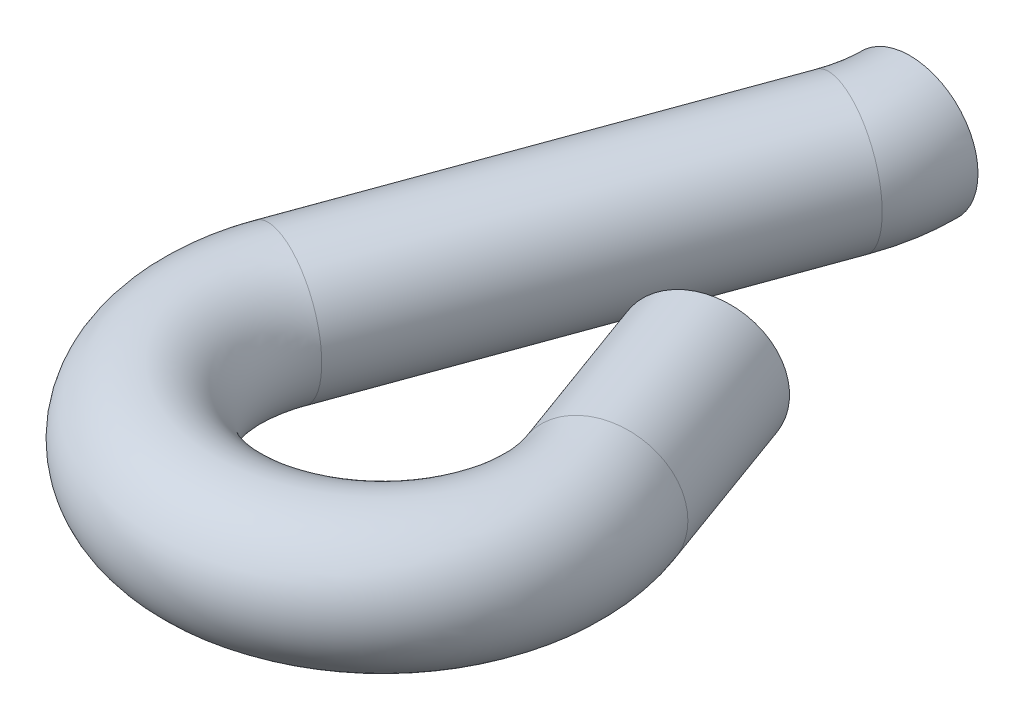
ISO-10303-21;
HEADER;
FILE_DESCRIPTION(('STEP AP214'),'2;1');
FILE_NAME('part.step','',(''),(''),'','','');
FILE_SCHEMA(('AUTOMOTIVE_DESIGN { 1 0 10303 214 1 1 1 1 }'));
ENDSEC;
DATA;
#1=APPLICATION_CONTEXT('core data for automotive mechanical design processes');
#2=APPLICATION_PROTOCOL_DEFINITION('international standard','automotive_design',2000,#1);
#3=PRODUCT_CONTEXT('',#1,'mechanical');
#4=PRODUCT('Part','Part','',(#3));
#5=PRODUCT_RELATED_PRODUCT_CATEGORY('part','',(#4));
#6=PRODUCT_DEFINITION_FORMATION('','',#4);
#7=PRODUCT_DEFINITION_CONTEXT('part definition',#1,'design');
#8=PRODUCT_DEFINITION('design','',#6,#7);
#9=PRODUCT_DEFINITION_SHAPE('','',#8);
#10=(LENGTH_UNIT() NAMED_UNIT(*) SI_UNIT(.MILLI.,.METRE.));
#11=(NAMED_UNIT(*) PLANE_ANGLE_UNIT() SI_UNIT($,.RADIAN.));
#12=(NAMED_UNIT(*) SI_UNIT($,.STERADIAN.) SOLID_ANGLE_UNIT());
#13=UNCERTAINTY_MEASURE_WITH_UNIT(LENGTH_MEASURE(1.E-05),#10,'distance_accuracy_value','');
#14=(GEOMETRIC_REPRESENTATION_CONTEXT(3) GLOBAL_UNCERTAINTY_ASSIGNED_CONTEXT((#13)) GLOBAL_UNIT_ASSIGNED_CONTEXT((#10,
#11,#12)) REPRESENTATION_CONTEXT('',''));
#15=CARTESIAN_POINT('',(0.,0.,0.));
#16=DIRECTION('',(0.,0.,1.));
#17=DIRECTION('',(1.,0.,0.));
#18=AXIS2_PLACEMENT_3D('',#15,#16,#17);
#19=CARTESIAN_POINT('',(0.,0.,-15.5));
#20=DIRECTION('',(0.,0.,1.));
#21=DIRECTION('',(1.,0.,0.));
#22=AXIS2_PLACEMENT_3D('',#19,#20,#21);
#23=PLANE('',#22);
#24=CARTESIAN_POINT('',(-2.,0.,-15.5));
#25=CARTESIAN_POINT('',(-1.99999501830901,-0.112340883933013,-15.5));
#26=CARTESIAN_POINT('',(-1.99050288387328,-0.22476322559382,-15.5));
#27=CARTESIAN_POINT('',(-1.95276859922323,-0.446511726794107,-15.5));
#28=CARTESIAN_POINT('',(-1.92450388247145,-0.55583399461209,-15.5));
#29=CARTESIAN_POINT('',(-1.85002906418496,-0.768137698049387,-15.5));
#30=CARTESIAN_POINT('',(-1.80382753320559,-0.871122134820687,-15.5));
#31=CARTESIAN_POINT('',(-1.69480235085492,-1.06784380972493,-15.5));
#32=CARTESIAN_POINT('',(-1.6319828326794,-1.16158333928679,-15.5));
#33=CARTESIAN_POINT('',(-1.49149220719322,-1.33719709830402,-15.5));
#34=CARTESIAN_POINT('',(-1.41381954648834,-1.41907008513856,-15.5));
#35=CARTESIAN_POINT('',(-1.24582829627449,-1.56861687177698,-15.5));
#36=CARTESIAN_POINT('',(-1.15550921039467,-1.63629011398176,-15.5));
#37=CARTESIAN_POINT('',(-0.964793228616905,-1.75551140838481,-15.5));
#38=CARTESIAN_POINT('',(-0.864396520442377,-1.80705976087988,-15.5));
#39=CARTESIAN_POINT('',(-0.656374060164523,-1.89256952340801,-15.5));
#40=CARTESIAN_POINT('',(-0.548748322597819,-1.92653096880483,-15.5));
#41=CARTESIAN_POINT('',(-0.329322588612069,-1.97590307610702,-15.5));
#42=CARTESIAN_POINT('',(-0.217522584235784,-1.99131370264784,-15.5));
#43=CARTESIAN_POINT('',(0.00707760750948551,-2.00314657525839,-15.5));
#44=CARTESIAN_POINT('',(0.119877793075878,-1.99956885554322,-15.5));
#45=CARTESIAN_POINT('',(0.343276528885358,-1.97352667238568,-15.5));
#46=CARTESIAN_POINT('',(0.453875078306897,-1.95106220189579,-15.5));
#47=CARTESIAN_POINT('',(0.669731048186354,-1.88788417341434,-15.5));
#48=CARTESIAN_POINT('',(0.774988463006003,-1.8471705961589,-15.5));
#49=CARTESIAN_POINT('',(0.977174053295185,-1.74865010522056,-15.5));
#50=CARTESIAN_POINT('',(1.07410223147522,-1.69084319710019,-15.5));
#51=CARTESIAN_POINT('',(1.25687784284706,-1.55977703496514,-15.5));
#52=CARTESIAN_POINT('',(1.34272528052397,-1.48651778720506,-15.5));
#53=CARTESIAN_POINT('',(1.50090251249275,-1.32662653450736,-15.5));
#54=CARTESIAN_POINT('',(1.57323230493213,-1.23999452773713,-15.5));
#55=CARTESIAN_POINT('',(1.70232101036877,-1.05581697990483,-15.5));
#56=CARTESIAN_POINT('',(1.75907992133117,-0.958271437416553,-15.5));
#57=CARTESIAN_POINT('',(1.85541563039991,-0.755035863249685,-15.5));
#58=CARTESIAN_POINT('',(1.89499242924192,-0.649345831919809,-15.5));
#59=CARTESIAN_POINT('',(1.95584044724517,-0.432821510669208,-15.5));
#60=CARTESIAN_POINT('',(1.9771116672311,-0.321987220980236,-15.5));
#61=CARTESIAN_POINT('',(2.00074470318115,-0.0983206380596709,-15.5));
#62=CARTESIAN_POINT('',(2.00310651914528,0.0145116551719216,-15.5));
#63=CARTESIAN_POINT('',(1.98885370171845,0.238971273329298,-15.5));
#64=CARTESIAN_POINT('',(1.97223906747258,0.350598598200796,-15.5));
#65=CARTESIAN_POINT('',(1.92050498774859,0.569479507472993,-15.5));
#66=CARTESIAN_POINT('',(1.88538554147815,0.676733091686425,-15.5));
#67=CARTESIAN_POINT('',(1.7976387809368,0.88382188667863,-15.5));
#68=CARTESIAN_POINT('',(1.74501146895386,0.983657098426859,-15.5));
#69=CARTESIAN_POINT('',(1.62374291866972,1.17307512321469,-15.5));
#70=CARTESIAN_POINT('',(1.55510168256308,1.2626579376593,-15.5));
#71=CARTESIAN_POINT('',(1.40375377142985,1.4290282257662,-15.5));
#72=CARTESIAN_POINT('',(1.32104709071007,1.50581569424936,-15.5));
#73=CARTESIAN_POINT('',(1.14391608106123,1.64441549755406,-15.5));
#74=CARTESIAN_POINT('',(1.04949174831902,1.70622782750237,-15.5));
#75=CARTESIAN_POINT('',(0.851605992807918,1.81312259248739,-15.5));
#76=CARTESIAN_POINT('',(0.748144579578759,1.85820504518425,-15.5));
#77=CARTESIAN_POINT('',(0.535121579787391,1.93036037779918,-15.5));
#78=CARTESIAN_POINT('',(0.425559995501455,1.95743326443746,-15.5));
#79=CARTESIAN_POINT('',(0.203446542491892,1.99280100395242,-15.5));
#80=CARTESIAN_POINT('',(0.0908946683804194,2.00109582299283,-15.5));
#81=CARTESIAN_POINT('',(-0.134003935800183,1.99867186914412,-15.5));
#82=CARTESIAN_POINT('',(-0.24635066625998,1.98795313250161,-15.5));
#83=CARTESIAN_POINT('',(-0.467650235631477,1.94780635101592,-15.5));
#84=CARTESIAN_POINT('',(-0.576603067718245,1.9183782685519,-15.5));
#85=CARTESIAN_POINT('',(-0.788023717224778,1.84164749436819,-15.5));
#86=CARTESIAN_POINT('',(-0.890491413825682,1.79434446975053,-15.5));
#87=CARTESIAN_POINT('',(-1.08602688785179,1.6832086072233,-15.5));
#88=CARTESIAN_POINT('',(-1.17909503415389,1.61937641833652,-15.5));
#89=CARTESIAN_POINT('',(-1.35318491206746,1.47700183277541,-15.5));
#90=CARTESIAN_POINT('',(-1.43420790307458,1.39846097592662,-15.5));
#91=CARTESIAN_POINT('',(-1.5819385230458,1.22886860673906,-15.5));
#92=CARTESIAN_POINT('',(-1.64864258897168,1.13781398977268,-15.5));
#93=CARTESIAN_POINT('',(-1.76584229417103,0.945762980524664,-15.5));
#94=CARTESIAN_POINT('',(-1.81633017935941,0.844761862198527,-15.5));
#95=CARTESIAN_POINT('',(-1.89957454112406,0.635796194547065,-15.5));
#96=CARTESIAN_POINT('',(-1.93235227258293,0.527840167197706,-15.5));
#97=CARTESIAN_POINT('',(-1.97050988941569,0.349330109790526,-15.5));
#98=CARTESIAN_POINT('',(-1.98155487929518,0.279935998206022,-15.5));
#99=CARTESIAN_POINT('',(-1.99630149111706,0.140371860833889,-15.5));
#100=CARTESIAN_POINT('',(-2.00000311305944,0.0702018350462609,-15.5));
#101=CARTESIAN_POINT('',(-2.,0.,-15.5));
#102=B_SPLINE_CURVE_WITH_KNOTS('',3,(#24,#25,#26,#27,#28,#29,#30,#31,#32,#33,#34,#35,#36,#37,
#38,#39,#40,#41,#42,#43,#44,#45,#46,#47,#48,#49,#50,#51,#52,#53,#54,#55,#56,#57,#58,#59,#60,#61,
#62,#63,#64,#65,#66,#67,#68,#69,#70,#71,#72,#73,#74,#75,#76,#77,#78,#79,#80,#81,#82,#83,#84,#85,
#86,#87,#88,#89,#90,#91,#92,#93,#94,#95,#96,#97,#98,#99,#100,#101),.UNSPECIFIED.,.T.,.F.,(4,2,2,
2,2,2,2,2,2,2,2,2,2,2,2,2,2,2,2,2,2,2,2,2,2,2,2,2,2,2,2,2,2,2,2,2,2,2,4),(0.,0.336766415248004,
0.67393839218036,1.01094945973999,1.34787678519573,1.68483936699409,2.02181517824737,
2.3587847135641,2.69575357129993,3.03272307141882,3.36969196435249,3.70666098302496,
4.04363035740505,4.38059962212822,4.71756875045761,5.05453792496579,5.39150714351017,
5.72847634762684,6.06544553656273,6.40241472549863,6.7393839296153,7.07635314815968,
7.41332232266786,7.75029145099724,8.08726071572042,8.42423009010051,8.76119910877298,
9.09816800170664,9.43513750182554,9.77210635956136,10.1090758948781,10.4460517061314,
10.7830142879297,11.1199416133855,11.4569526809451,11.7941246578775,12.1308910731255,
12.3413364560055,12.5517818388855),.UNSPECIFIED.);
#103=CARTESIAN_POINT('',(-2.,0.,-15.5));
#104=VERTEX_POINT('',#103);
#105=EDGE_CURVE('E20',#104,#104,#102,.T.);
#106=ORIENTED_EDGE('',*,*,#105,.F.);
#107=EDGE_LOOP('',(#106));
#108=FACE_BOUND('',#107,.T.);
#109=ADVANCED_FACE('F16',(#108),#23,.F.);
#110=CARTESIAN_POINT('',(-5.,0.,-15.5));
#111=DIRECTION('',(0.,1.,0.));
#112=DIRECTION('',(0.,0.,1.));
#113=AXIS2_PLACEMENT_3D('',#110,#111,#112);
#114=TOROIDAL_SURFACE('',#113,5.,2.);
#115=CARTESIAN_POINT('',(-0.301431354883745,-1.99999999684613,-13.7905177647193));
#116=CARTESIAN_POINT('',(-0.332183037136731,-1.99999885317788,-13.8017061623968));
#117=CARTESIAN_POINT('',(-0.362934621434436,-1.99919321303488,-13.8128945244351));
#118=CARTESIAN_POINT('',(-0.424363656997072,-1.9959779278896,-13.8352442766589));
#119=CARTESIAN_POINT('',(-0.455041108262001,-1.99356828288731,-13.8464056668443));
#120=CARTESIAN_POINT('',(-0.516247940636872,-1.98714997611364,-13.8686745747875));
#121=CARTESIAN_POINT('',(-0.546777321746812,-1.98314131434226,-13.8797820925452));
#122=CARTESIAN_POINT('',(-0.607614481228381,-1.97353484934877,-13.9019165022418));
#123=CARTESIAN_POINT('',(-0.637922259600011,-1.96793704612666,-13.9129433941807));
#124=CARTESIAN_POINT('',(-0.698243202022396,-1.95516572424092,-13.9348899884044));
#125=CARTESIAN_POINT('',(-0.728256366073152,-1.9479922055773,-13.9458096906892));
#126=CARTESIAN_POINT('',(-0.787915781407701,-1.9320867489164,-13.9675156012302));
#127=CARTESIAN_POINT('',(-0.817562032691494,-1.92335481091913,-13.9783018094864));
#128=CARTESIAN_POINT('',(-0.876416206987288,-1.90435354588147,-13.9997147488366));
#129=CARTESIAN_POINT('',(-0.905624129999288,-1.89408421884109,-14.0103414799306));
#130=CARTESIAN_POINT('',(-0.963531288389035,-1.87203291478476,-14.0314098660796));
#131=CARTESIAN_POINT('',(-0.992230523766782,-1.8602509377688,-14.0418515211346));
#132=CARTESIAN_POINT('',(-1.04905117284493,-1.83520271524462,-14.0625246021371));
#133=CARTESIAN_POINT('',(-1.07717258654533,-1.82193646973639,-14.0727560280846));
#134=CARTESIAN_POINT('',(-1.13276985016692,-1.7939516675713,-14.0929840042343));
#135=CARTESIAN_POINT('',(-1.1602457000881,-1.77923311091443,-14.1029805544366));
#136=CARTESIAN_POINT('',(-1.21448564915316,-1.74837914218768,-14.122714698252));
#137=CARTESIAN_POINT('',(-1.24124974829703,-1.73224373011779,-14.1324522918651));
#138=CARTESIAN_POINT('',(-1.29400172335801,-1.69859491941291,-14.1516450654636));
#139=CARTESIAN_POINT('',(-1.31998959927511,-1.6810815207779,-14.161100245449));
#140=CARTESIAN_POINT('',(-1.37112652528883,-1.64471892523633,-14.1797054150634));
#141=CARTESIAN_POINT('',(-1.39627557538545,-1.62586972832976,-14.1888554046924));
#142=CARTESIAN_POINT('',(-1.44567426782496,-1.58688094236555,-14.2068281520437));
#143=CARTESIAN_POINT('',(-1.46992391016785,-1.56674135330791,-14.215650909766));
#144=CARTESIAN_POINT('',(-1.51746537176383,-1.52522029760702,-14.2329479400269));
#145=CARTESIAN_POINT('',(-1.54075719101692,-1.50383883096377,-14.2414222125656));
#146=CARTESIAN_POINT('',(-1.58632689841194,-1.45988552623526,-14.2580018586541));
#147=CARTESIAN_POINT('',(-1.60860478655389,-1.43731368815,-14.266107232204));
#148=CARTESIAN_POINT('',(-1.65209296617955,-1.3910340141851,-14.2819295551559));
#149=CARTESIAN_POINT('',(-1.67330325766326,-1.36732617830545,-14.289646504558));
#150=CARTESIAN_POINT('',(-1.71460515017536,-1.31883161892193,-14.3046733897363));
#151=CARTESIAN_POINT('',(-1.73469675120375,-1.29404489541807,-14.3119833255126));
#152=CARTESIAN_POINT('',(-1.77371286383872,-1.24345226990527,-14.3261785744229));
#153=CARTESIAN_POINT('',(-1.79263737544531,-1.21764636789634,-14.3330638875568));
#154=CARTESIAN_POINT('',(-1.82927372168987,-1.16507754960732,-14.3463933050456));
#155=CARTESIAN_POINT('',(-1.84698555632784,-1.13831463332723,-14.3528374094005));
#156=CARTESIAN_POINT('',(-1.88115388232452,-1.0838962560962,-14.3652688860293));
#157=CARTESIAN_POINT('',(-1.89761037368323,-1.05624079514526,-14.3712562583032));
#158=CARTESIAN_POINT('',(-1.92922837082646,-1.00010394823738,-14.3827598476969));
#159=CARTESIAN_POINT('',(-1.94438987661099,-0.971622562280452,-14.3882760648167));
#160=CARTESIAN_POINT('',(-1.97338137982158,-0.913902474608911,-14.398824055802));
#161=CARTESIAN_POINT('',(-1.98721137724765,-0.884663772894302,-14.4038558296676));
#162=CARTESIAN_POINT('',(-2.013506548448,-0.825499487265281,-14.4134228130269));
#163=CARTESIAN_POINT('',(-2.02597172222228,-0.79557390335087,-14.4179580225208));
#164=CARTESIAN_POINT('',(-2.04950721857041,-0.735107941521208,-14.426520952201));
#165=CARTESIAN_POINT('',(-2.06057754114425,-0.704567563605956,-14.4305486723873));
#166=CARTESIAN_POINT('',(-2.08129666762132,-0.642945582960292,-14.4380869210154));
#167=CARTESIAN_POINT('',(-2.09094547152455,-0.611863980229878,-14.4415974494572));
#168=CARTESIAN_POINT('',(-2.1087983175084,-0.549234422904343,-14.4480928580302));
#169=CARTESIAN_POINT('',(-2.11700235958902,-0.517686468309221,-14.4510777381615));
#170=CARTESIAN_POINT('',(-2.13194591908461,-0.454200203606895,-14.45651465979));
#171=CARTESIAN_POINT('',(-2.13868543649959,-0.422261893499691,-14.4589667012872));
#172=CARTESIAN_POINT('',(-2.15068371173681,-0.358071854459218,-14.4633320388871));
#173=CARTESIAN_POINT('',(-2.15594246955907,-0.32582012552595,-14.4652453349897));
#174=CARTESIAN_POINT('',(-2.16496655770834,-0.261080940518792,-14.4685285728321));
#175=CARTESIAN_POINT('',(-2.16873188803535,-0.228593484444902,-14.4698985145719));
#176=CARTESIAN_POINT('',(-2.17476005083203,-0.163461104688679,-14.4720917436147));
#177=CARTESIAN_POINT('',(-2.17702288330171,-0.130816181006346,-14.4729150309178));
#178=CARTESIAN_POINT('',(-2.18004059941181,-0.0654475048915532,-14.474012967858));
#179=CARTESIAN_POINT('',(-2.18079548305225,-0.0327237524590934,-14.474287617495));
#180=CARTESIAN_POINT('',(-2.18079548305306,0.0327237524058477,-14.4742876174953));
#181=CARTESIAN_POINT('',(-2.18004059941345,0.0654475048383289,-14.4740129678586));
#182=CARTESIAN_POINT('',(-2.17702288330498,0.130816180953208,-14.472915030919));
#183=CARTESIAN_POINT('',(-2.17476005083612,0.163461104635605,-14.4720917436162));
#184=CARTESIAN_POINT('',(-2.16873188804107,0.228593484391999,-14.4698985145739));
#185=CARTESIAN_POINT('',(-2.16496655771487,0.261080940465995,-14.4685285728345));
#186=CARTESIAN_POINT('',(-2.15594246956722,0.325820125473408,-14.4652453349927));
#187=CARTESIAN_POINT('',(-2.15068371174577,0.358071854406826,-14.4633320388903));
#188=CARTESIAN_POINT('',(-2.13868543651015,0.422261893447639,-14.458966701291));
#189=CARTESIAN_POINT('',(-2.13194591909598,0.454200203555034,-14.4565146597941));
#190=CARTESIAN_POINT('',(-2.11700235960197,0.517686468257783,-14.4510777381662));
#191=CARTESIAN_POINT('',(-2.10879831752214,0.549234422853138,-14.4480928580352));
#192=CARTESIAN_POINT('',(-2.09094547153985,0.611863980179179,-14.4415974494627));
#193=CARTESIAN_POINT('',(-2.0812966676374,0.642945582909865,-14.4380869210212));
#194=CARTESIAN_POINT('',(-2.06057754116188,0.704567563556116,-14.4305486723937));
#195=CARTESIAN_POINT('',(-2.0495072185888,0.735107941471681,-14.4265209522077));
#196=CARTESIAN_POINT('',(-2.02597172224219,0.795573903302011,-14.417958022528));
#197=CARTESIAN_POINT('',(-2.01350654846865,0.825499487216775,-14.4134228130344));
#198=CARTESIAN_POINT('',(-1.98721137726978,0.884663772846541,-14.4038558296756));
#199=CARTESIAN_POINT('',(-1.97338137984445,0.913902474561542,-14.3988240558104));
#200=CARTESIAN_POINT('',(-1.9443898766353,0.971622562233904,-14.3882760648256));
#201=CARTESIAN_POINT('',(-1.92922837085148,1.00010394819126,-14.382759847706));
#202=CARTESIAN_POINT('',(-1.89761037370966,1.05624079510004,-14.3712562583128));
#203=CARTESIAN_POINT('',(-1.88115388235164,1.08389625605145,-14.3652688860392));
#204=CARTESIAN_POINT('',(-1.84698555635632,1.13831463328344,-14.3528374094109));
#205=CARTESIAN_POINT('',(-1.82927372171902,1.16507754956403,-14.3463933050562));
#206=CARTESIAN_POINT('',(-1.79263737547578,1.21764636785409,-14.3330638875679));
#207=CARTESIAN_POINT('',(-1.77371286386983,1.24345226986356,-14.3261785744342));
#208=CARTESIAN_POINT('',(-1.73469675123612,1.29404489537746,-14.3119833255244));
#209=CARTESIAN_POINT('',(-1.71460515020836,1.31883161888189,-14.3046733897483));
#210=CARTESIAN_POINT('',(-1.67330325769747,1.36732617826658,-14.2896465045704));
#211=CARTESIAN_POINT('',(-1.65209296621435,1.39103401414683,-14.2819295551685));
#212=CARTESIAN_POINT('',(-1.60860478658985,1.43731368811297,-14.2661072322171));
#213=CARTESIAN_POINT('',(-1.58632689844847,1.45988552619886,-14.2580018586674));
#214=CARTESIAN_POINT('',(-1.54075719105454,1.50383883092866,-14.2414222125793));
#215=CARTESIAN_POINT('',(-1.51746537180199,1.52522029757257,-14.2329479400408));
#216=CARTESIAN_POINT('',(-1.46992391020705,1.5667413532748,-14.2156509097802));
#217=CARTESIAN_POINT('',(-1.44567426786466,1.58688094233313,-14.2068281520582));
#218=CARTESIAN_POINT('',(-1.39627557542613,1.62586972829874,-14.1888554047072));
#219=CARTESIAN_POINT('',(-1.37112652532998,1.64471892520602,-14.1797054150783));
#220=CARTESIAN_POINT('',(-1.31998959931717,1.68108152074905,-14.1611002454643));
#221=CARTESIAN_POINT('',(-1.2940017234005,1.69859491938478,-14.1516450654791));
#222=CARTESIAN_POINT('',(-1.24124974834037,1.73224373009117,-14.1324522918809));
#223=CARTESIAN_POINT('',(-1.2144856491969,1.74837914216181,-14.1227146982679));
#224=CARTESIAN_POINT('',(-1.16024570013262,1.7792331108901,-14.1029805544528));
#225=CARTESIAN_POINT('',(-1.1327698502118,1.79395166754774,-14.0929840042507));
#226=CARTESIAN_POINT('',(-1.07717258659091,1.82193646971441,-14.0727560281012));
#227=CARTESIAN_POINT('',(-1.04905117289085,1.83520271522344,-14.0625246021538));
#228=CARTESIAN_POINT('',(-0.992230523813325,1.86025093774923,-14.0418515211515));
#229=CARTESIAN_POINT('',(-0.963531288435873,1.872032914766,-14.0314098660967));
#230=CARTESIAN_POINT('',(-0.905624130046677,1.89408421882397,-14.0103414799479));
#231=CARTESIAN_POINT('',(-0.876416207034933,1.90435354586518,-13.999714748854));
#232=CARTESIAN_POINT('',(-0.817562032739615,1.9233548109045,-13.9783018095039));
#233=CARTESIAN_POINT('',(-0.787915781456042,1.93208674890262,-13.9675156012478));
#234=CARTESIAN_POINT('',(-0.728256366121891,1.94799220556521,-13.9458096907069));
#235=CARTESIAN_POINT('',(-0.698243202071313,1.95516572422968,-13.9348899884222));
#236=CARTESIAN_POINT('',(-0.637922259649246,1.96793704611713,-13.9129433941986));
#237=CARTESIAN_POINT('',(-0.607614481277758,1.9735348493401,-13.9019165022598));
#238=CARTESIAN_POINT('',(-0.546777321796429,1.98314131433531,-13.8797820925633));
#239=CARTESIAN_POINT('',(-0.516247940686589,1.98714997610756,-13.8686745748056));
#240=CARTESIAN_POINT('',(-0.455041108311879,1.99356828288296,-13.8464056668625));
#241=CARTESIAN_POINT('',(-0.424363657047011,1.99597792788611,-13.8352442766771));
#242=CARTESIAN_POINT('',(-0.362934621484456,1.99919321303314,-13.8128945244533));
#243=CARTESIAN_POINT('',(-0.33218303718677,1.99999885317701,-13.801706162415));
#244=CARTESIAN_POINT('',(-0.301431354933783,1.99999999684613,-13.7905177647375));
#245=B_SPLINE_CURVE_WITH_KNOTS('',3,(#115,#116,#117,#118,#119,#120,#121,#122,#123,#124,#125,
#126,#127,#128,#129,#130,#131,#132,#133,#134,#135,#136,#137,#138,#139,#140,#141,#142,#143,#144,
#145,#146,#147,#148,#149,#150,#151,#152,#153,#154,#155,#156,#157,#158,#159,#160,#161,#162,#163,
#164,#165,#166,#167,#168,#169,#170,#171,#172,#173,#174,#175,#176,#177,#178,#179,#180,#181,#182,
#183,#184,#185,#186,#187,#188,#189,#190,#191,#192,#193,#194,#195,#196,#197,#198,#199,#200,#201,
#202,#203,#204,#205,#206,#207,#208,#209,#210,#211,#212,#213,#214,#215,#216,#217,#218,#219,#220,
#221,#222,#223,#224,#225,#226,#227,#228,#229,#230,#231,#232,#233,#234,#235,#236,#237,#238,#239,
#240,#241,#242,#243,#244),.UNSPECIFIED.,.F.,.F.,(4,2,2,2,2,2,2,2,2,2,2,2,2,2,2,2,2,2,2,2,2,2,2,
2,2,2,2,2,2,2,2,2,2,2,2,2,2,2,2,2,2,2,2,2,2,2,2,2,2,2,2,2,2,2,2,2,2,2,2,2,2,2,2,2,4),(0.,
0.0981614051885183,0.196322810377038,0.294484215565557,0.392645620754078,0.490807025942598,
0.588968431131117,0.687129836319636,0.785291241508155,0.883452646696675,0.981614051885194,
1.07977545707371,1.17793686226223,1.27609826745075,1.37425967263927,1.47242107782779,
1.57058248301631,1.66874388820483,1.76690529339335,1.86506669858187,1.96322810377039,
2.06138950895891,2.15955091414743,2.25771231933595,2.35587372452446,2.45403512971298,
2.5521965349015,2.65035794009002,2.74851934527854,2.84668075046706,2.94484215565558,
3.0430035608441,3.14116496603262,3.23932637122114,3.33748777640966,3.43564918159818,
3.5338105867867,3.63197199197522,3.73013339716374,3.82829480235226,3.92645620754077,
4.02461761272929,4.12277901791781,4.22094042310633,4.31910182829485,4.41726323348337,
4.51542463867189,4.61358604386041,4.71174744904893,4.80990885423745,4.90807025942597,
5.00623166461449,5.10439306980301,5.20255447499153,5.30071588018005,5.39887728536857,
5.49703869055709,5.5952000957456,5.69336150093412,5.79152290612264,5.88968431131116,
5.98784571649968,6.0860071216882,6.18416852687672,6.28232993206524),.UNSPECIFIED.);
#246=CARTESIAN_POINT('',(-0.301536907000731,1.99999999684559,-13.790227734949));
#247=VERTEX_POINT('',#246);
#248=CARTESIAN_POINT('',(-0.30153690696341,-1.99999999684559,-13.7902277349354));
#249=VERTEX_POINT('',#248);
#250=EDGE_CURVE('E37',#247,#249,#245,.F.);
#251=ORIENTED_EDGE('',*,*,#250,.F.);
#252=CARTESIAN_POINT('',(-0.301642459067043,1.99999999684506,-13.7899377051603));
#253=CARTESIAN_POINT('',(-0.270889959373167,2.00000252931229,-13.7787447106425));
#254=CARTESIAN_POINT('',(-0.240137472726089,1.99920045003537,-13.7675517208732));
#255=CARTESIAN_POINT('',(-0.178706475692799,1.99599204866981,-13.7451926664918));
#256=CARTESIAN_POINT('',(-0.148027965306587,1.99358572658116,-13.7340266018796));
#257=CARTESIAN_POINT('',(-0.0868188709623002,1.98717382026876,-13.7117483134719));
#258=CARTESIAN_POINT('',(-0.0562882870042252,1.983168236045,-13.7006360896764));
#259=CARTESIAN_POINT('',(0.00455140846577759,1.97356767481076,-13.6784922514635));
#260=CARTESIAN_POINT('',(0.0348605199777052,1.96797269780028,-13.6674606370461));
#261=CARTESIAN_POINT('',(0.0951842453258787,1.95520677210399,-13.6455045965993));
#262=CARTESIAN_POINT('',(0.125198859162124,1.94803582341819,-13.6345801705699));
#263=CARTESIAN_POINT('',(0.184861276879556,1.93213524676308,-13.6128648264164));
#264=CARTESIAN_POINT('',(0.214509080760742,1.92340561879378,-13.6020739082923));
#265=CARTESIAN_POINT('',(0.273366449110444,1.90440871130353,-13.5806515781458));
#266=CARTESIAN_POINT('',(0.302576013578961,1.89414143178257,-13.5700201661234));
#267=CARTESIAN_POINT('',(0.36048652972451,1.87209395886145,-13.5489424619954));
#268=CARTESIAN_POINT('',(0.389187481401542,1.86031376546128,-13.5384961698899));
#269=CARTESIAN_POINT('',(0.446011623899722,1.83526884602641,-13.5178138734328));
#270=CARTESIAN_POINT('',(0.474134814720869,1.8220041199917,-13.5075778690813));
#271=CARTESIAN_POINT('',(0.529735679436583,1.79402209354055,-13.4873408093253));
#272=CARTESIAN_POINT('',(0.55721335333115,1.77930479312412,-13.4773397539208));
#273=CARTESIAN_POINT('',(0.611456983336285,1.74845307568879,-13.4575966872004));
#274=CARTESIAN_POINT('',(0.638222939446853,1.73231865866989,-13.4478546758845));
#275=CARTESIAN_POINT('',(0.690978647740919,1.69867158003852,-13.4286531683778));
#276=CARTESIAN_POINT('',(0.716968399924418,1.68115891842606,-13.4191936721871));
#277=CARTESIAN_POINT('',(0.768109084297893,1.64479754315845,-13.4005799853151));
#278=CARTESIAN_POINT('',(0.793260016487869,1.62594882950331,-13.3914257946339));
#279=CARTESIAN_POINT('',(0.842662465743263,1.58696076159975,-13.3734447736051));
#280=CARTESIAN_POINT('',(0.86691398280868,1.56682140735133,-13.3646179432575));
#281=CARTESIAN_POINT('',(0.914459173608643,1.52530057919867,-13.3473129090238));
#282=CARTESIAN_POINT('',(0.93775284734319,1.50391910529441,-13.3388347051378));
#283=CARTESIAN_POINT('',(0.983326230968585,1.45996555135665,-13.3222473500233));
#284=CARTESIAN_POINT('',(1.00560594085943,1.43739347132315,-13.314138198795));
#285=CARTESIAN_POINT('',(1.04909771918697,1.39111308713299,-13.2983084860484));
#286=CARTESIAN_POINT('',(1.07030978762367,1.36740478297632,-13.2905879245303));
#287=CARTESIAN_POINT('',(1.11161517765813,1.3189090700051,-13.275553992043));
#288=CARTESIAN_POINT('',(1.1317084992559,1.29412166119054,-13.2682406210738));
#289=CARTESIAN_POINT('',(1.17072798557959,1.24352745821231,-13.2540386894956));
#290=CARTESIAN_POINT('',(1.18965415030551,1.21772066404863,-13.2471501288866));
#291=CARTESIAN_POINT('',(1.22629372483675,1.16514986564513,-13.233814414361));
#292=CARTESIAN_POINT('',(1.24400713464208,1.13838586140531,-13.2273672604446));
#293=CARTESIAN_POINT('',(1.27817852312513,1.0839651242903,-13.2149298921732));
#294=CARTESIAN_POINT('',(1.29463650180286,1.05630839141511,-13.2089396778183));
#295=CARTESIAN_POINT('',(1.32625737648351,1.00016882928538,-13.1974306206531));
#296=CARTESIAN_POINT('',(1.34142027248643,0.971686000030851,-13.1919117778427));
#297=CARTESIAN_POINT('',(1.37041445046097,0.913962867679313,-13.181358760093));
#298=CARTESIAN_POINT('',(1.38424573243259,0.884722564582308,-13.1763245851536));
#299=CARTESIAN_POINT('',(1.41054335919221,0.825554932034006,-13.1667530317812));
#300=CARTESIAN_POINT('',(1.42300970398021,0.795627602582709,-13.1622156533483));
#301=CARTESIAN_POINT('',(1.44654742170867,0.735158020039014,-13.1536486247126));
#302=CARTESIAN_POINT('',(1.45761879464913,0.704615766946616,-13.1496189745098));
#303=CARTESIAN_POINT('',(1.47833989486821,0.642989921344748,-13.1420771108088));
#304=CARTESIAN_POINT('',(1.48798962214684,0.611906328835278,-13.1385648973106));
#305=CARTESIAN_POINT('',(1.50584418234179,0.549272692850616,-13.1320663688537));
#306=CARTESIAN_POINT('',(1.51404901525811,0.517722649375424,-13.1290800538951));
#307=CARTESIAN_POINT('',(1.52899401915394,0.454232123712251,-13.123640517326));
#308=CARTESIAN_POINT('',(1.53573419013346,0.42229164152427,-13.1211872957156));
#309=CARTESIAN_POINT('',(1.54773363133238,0.358097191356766,-13.1168198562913));
#310=CARTESIAN_POINT('',(1.55299290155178,0.325843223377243,-13.1149056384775));
#311=CARTESIAN_POINT('',(1.56201787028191,0.26109950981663,-13.1116208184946));
#312=CARTESIAN_POINT('',(1.56578356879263,0.22860976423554,-13.1102502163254));
#313=CARTESIAN_POINT('',(1.57181232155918,0.16347277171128,-13.1080559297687));
#314=CARTESIAN_POINT('',(1.57407537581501,0.13082552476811,-13.107232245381));
#315=CARTESIAN_POINT('',(1.57709338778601,0.0654521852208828,-13.1061337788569));
#316=CARTESIAN_POINT('',(1.57784834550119,0.0327260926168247,-13.1058589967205));
#317=CARTESIAN_POINT('',(1.57784834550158,-0.0327260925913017,-13.1058589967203));
#318=CARTESIAN_POINT('',(1.57709338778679,-0.0654521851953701,-13.1061337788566));
#319=CARTESIAN_POINT('',(1.57407537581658,-0.130825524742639,-13.1072322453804));
#320=CARTESIAN_POINT('',(1.57181232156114,-0.16347277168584,-13.1080559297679));
#321=CARTESIAN_POINT('',(1.56578356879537,-0.228609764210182,-13.1102502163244));
#322=CARTESIAN_POINT('',(1.56201787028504,-0.261099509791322,-13.1116208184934));
#323=CARTESIAN_POINT('',(1.55299290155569,-0.325843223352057,-13.1149056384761));
#324=CARTESIAN_POINT('',(1.54773363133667,-0.358097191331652,-13.1168198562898));
#325=CARTESIAN_POINT('',(1.53573419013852,-0.422291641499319,-13.1211872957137));
#326=CARTESIAN_POINT('',(1.52899401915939,-0.454232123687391,-13.123640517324));
#327=CARTESIAN_POINT('',(1.51404901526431,-0.517722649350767,-13.1290800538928));
#328=CARTESIAN_POINT('',(1.50584418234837,-0.549272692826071,-13.1320663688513));
#329=CARTESIAN_POINT('',(1.48798962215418,-0.611906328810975,-13.1385648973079));
#330=CARTESIAN_POINT('',(1.47833989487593,-0.642989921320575,-13.142077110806));
#331=CARTESIAN_POINT('',(1.45761879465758,-0.704615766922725,-13.1496189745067));
#332=CARTESIAN_POINT('',(1.44654742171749,-0.735158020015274,-13.1536486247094));
#333=CARTESIAN_POINT('',(1.42300970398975,-0.795627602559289,-13.1622156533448));
#334=CARTESIAN_POINT('',(1.4105433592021,-0.825554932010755,-13.1667530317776));
#335=CARTESIAN_POINT('',(1.38424573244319,-0.884722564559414,-13.1763245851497));
#336=CARTESIAN_POINT('',(1.37041445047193,-0.913962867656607,-13.181358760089));
#337=CARTESIAN_POINT('',(1.34142027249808,-0.971686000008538,-13.1919117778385));
#338=CARTESIAN_POINT('',(1.3262573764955,-1.00016882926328,-13.1974306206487));
#339=CARTESIAN_POINT('',(1.29463650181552,-1.05630839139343,-13.2089396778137));
#340=CARTESIAN_POINT('',(1.27817852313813,-1.08396512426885,-13.2149298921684));
#341=CARTESIAN_POINT('',(1.24400713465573,-1.13838586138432,-13.2273672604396));
#342=CARTESIAN_POINT('',(1.22629372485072,-1.16514986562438,-13.233814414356));
#343=CARTESIAN_POINT('',(1.18965415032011,-1.21772066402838,-13.2471501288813));
#344=CARTESIAN_POINT('',(1.1707279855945,-1.24352745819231,-13.2540386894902));
#345=CARTESIAN_POINT('',(1.13170849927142,-1.29412166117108,-13.2682406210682));
#346=CARTESIAN_POINT('',(1.11161517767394,-1.31890906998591,-13.2755539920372));
#347=CARTESIAN_POINT('',(1.07030978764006,-1.36740478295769,-13.2905879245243));
#348=CARTESIAN_POINT('',(1.04909771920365,-1.39111308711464,-13.2983084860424));
#349=CARTESIAN_POINT('',(1.00560594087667,-1.4373934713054,-13.3141381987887));
#350=CARTESIAN_POINT('',(0.983326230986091,-1.4599655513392,-13.3222473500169));
#351=CARTESIAN_POINT('',(0.937752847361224,-1.50391910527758,-13.3388347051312));
#352=CARTESIAN_POINT('',(0.914459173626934,-1.52530057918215,-13.3473129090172));
#353=CARTESIAN_POINT('',(0.866913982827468,-1.56682140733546,-13.3646179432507));
#354=CARTESIAN_POINT('',(0.842662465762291,-1.58696076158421,-13.3734447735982));
#355=CARTESIAN_POINT('',(0.793260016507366,-1.62594882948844,-13.3914257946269));
#356=CARTESIAN_POINT('',(0.768109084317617,-1.64479754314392,-13.400579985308));
#357=CARTESIAN_POINT('',(0.716968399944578,-1.68115891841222,-13.4191936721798));
#358=CARTESIAN_POINT('',(0.690978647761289,-1.69867158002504,-13.4286531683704));
#359=CARTESIAN_POINT('',(0.638222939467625,-1.73231865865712,-13.447854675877));
#360=CARTESIAN_POINT('',(0.61145698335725,-1.74845307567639,-13.4575966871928));
#361=CARTESIAN_POINT('',(0.557213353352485,-1.77930479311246,-13.4773397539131));
#362=CARTESIAN_POINT('',(0.529735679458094,-1.79402209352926,-13.4873408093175));
#363=CARTESIAN_POINT('',(0.474134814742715,-1.82200411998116,-13.5075778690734));
#364=CARTESIAN_POINT('',(0.446011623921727,-1.83526884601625,-13.5178138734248));
#365=CARTESIAN_POINT('',(0.389187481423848,-1.8603137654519,-13.5384961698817));
#366=CARTESIAN_POINT('',(0.360486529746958,-1.87209395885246,-13.5489424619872));
#367=CARTESIAN_POINT('',(0.302576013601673,-1.89414143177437,-13.5700201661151));
#368=CARTESIAN_POINT('',(0.273366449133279,-1.90440871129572,-13.5806515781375));
#369=CARTESIAN_POINT('',(0.214509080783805,-1.92340561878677,-13.6020739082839));
#370=CARTESIAN_POINT('',(0.184861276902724,-1.93213524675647,-13.612864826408));
#371=CARTESIAN_POINT('',(0.125198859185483,-1.94803582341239,-13.6345801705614));
#372=CARTESIAN_POINT('',(0.0951842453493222,-1.95520677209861,-13.6455045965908));
#373=CARTESIAN_POINT('',(0.0348605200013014,-1.96797269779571,-13.6674606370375));
#374=CARTESIAN_POINT('',(0.00455140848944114,-1.9735676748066,-13.6784922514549));
#375=CARTESIAN_POINT('',(-0.0562882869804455,-1.98316823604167,-13.7006360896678));
#376=CARTESIAN_POINT('',(-0.086818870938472,-1.98717382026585,-13.7117483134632));
#377=CARTESIAN_POINT('',(-0.148027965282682,-1.99358572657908,-13.7340266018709));
#378=CARTESIAN_POINT('',(-0.178706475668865,-1.99599204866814,-13.7451926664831));
#379=CARTESIAN_POINT('',(-0.240137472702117,-1.99920045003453,-13.7675517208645));
#380=CARTESIAN_POINT('',(-0.270889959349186,-2.00000252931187,-13.7787447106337));
#381=CARTESIAN_POINT('',(-0.301642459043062,-1.99999999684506,-13.7899377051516));
#382=B_SPLINE_CURVE_WITH_KNOTS('',3,(#252,#253,#254,#255,#256,#257,#258,#259,#260,#261,#262,
#263,#264,#265,#266,#267,#268,#269,#270,#271,#272,#273,#274,#275,#276,#277,#278,#279,#280,#281,
#282,#283,#284,#285,#286,#287,#288,#289,#290,#291,#292,#293,#294,#295,#296,#297,#298,#299,#300,
#301,#302,#303,#304,#305,#306,#307,#308,#309,#310,#311,#312,#313,#314,#315,#316,#317,#318,#319,
#320,#321,#322,#323,#324,#325,#326,#327,#328,#329,#330,#331,#332,#333,#334,#335,#336,#337,#338,
#339,#340,#341,#342,#343,#344,#345,#346,#347,#348,#349,#350,#351,#352,#353,#354,#355,#356,#357,
#358,#359,#360,#361,#362,#363,#364,#365,#366,#367,#368,#369,#370,#371,#372,#373,#374,#375,#376,
#377,#378,#379,#380,#381),.UNSPECIFIED.,.F.,.F.,(4,2,2,2,2,2,2,2,2,2,2,2,2,2,2,2,2,2,2,2,2,2,2,
2,2,2,2,2,2,2,2,2,2,2,2,2,2,2,2,2,2,2,2,2,2,2,2,2,2,2,2,2,2,2,2,2,2,2,2,2,2,2,2,2,4),(0.,
0.0981684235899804,0.196336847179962,0.294505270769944,0.392673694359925,0.490842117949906,
0.589010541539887,0.687178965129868,0.785347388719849,0.88351581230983,0.981684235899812,
1.07985265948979,1.17802108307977,1.27618950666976,1.37435793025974,1.47252635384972,
1.5706947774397,1.66886320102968,1.76703162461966,1.86520004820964,1.96336847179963,
2.06153689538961,2.15970531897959,2.25787374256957,2.35604216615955,2.45421058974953,
2.55237901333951,2.6505474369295,2.74871586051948,2.84688428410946,2.94505270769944,
3.04322113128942,3.1413895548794,3.23955797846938,3.33772640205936,3.43589482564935,
3.53406324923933,3.63223167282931,3.73040009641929,3.82856852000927,3.92673694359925,
4.02490536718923,4.12307379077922,4.2212422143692,4.31941063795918,4.41757906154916,
4.51574748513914,4.61391590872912,4.7120843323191,4.81025275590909,4.90842117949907,
5.00658960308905,5.10475802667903,5.20292645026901,5.30109487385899,5.39926329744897,
5.49743172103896,5.59560014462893,5.69376856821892,5.7919369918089,5.89010541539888,
5.98827383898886,6.08644226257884,6.18461068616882,6.28277910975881),.UNSPECIFIED.);
#383=EDGE_CURVE('E34',#249,#247,#382,.F.);
#384=ORIENTED_EDGE('',*,*,#383,.F.);
#385=EDGE_LOOP('',(#251,#384));
#386=FACE_BOUND('',#385,.T.);
#387=ORIENTED_EDGE('',*,*,#105,.T.);
#388=EDGE_LOOP('',(#387));
#389=FACE_BOUND('',#388,.T.);
#390=ADVANCED_FACE('F39',(#386,#389),#114,.T.);
#391=CARTESIAN_POINT('',(2.98836239,0.,-6.40856382));
#392=DIRECTION('',(-0.342020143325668,0.,-0.939692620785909));
#393=DIRECTION('',(-0.939692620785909,0.,0.342020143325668));
#394=AXIS2_PLACEMENT_3D('',#391,#392,#393);
#395=PLANE('',#394);
#396=CARTESIAN_POINT('',(2.98836239,0.,-6.40856382));
#397=DIRECTION('',(-0.342020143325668,0.,-0.939692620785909));
#398=DIRECTION('',(-0.939692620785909,0.,0.342020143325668));
#399=AXIS2_PLACEMENT_3D('',#396,#397,#398);
#400=CIRCLE('',#399,2.);
#401=CARTESIAN_POINT('',(1.10897714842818,0.,-5.72452353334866));
#402=VERTEX_POINT('',#401);
#403=EDGE_CURVE('E48',#402,#402,#400,.F.);
#404=ORIENTED_EDGE('',*,*,#403,.F.);
#405=EDGE_LOOP('',(#404));
#406=FACE_BOUND('',#405,.T.);
#407=ADVANCED_FACE('F67',(#406),#395,.T.);
#408=CARTESIAN_POINT('',(-2.50000000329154,0.,-7.75032844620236));
#409=DIRECTION('',(0.342020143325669,0.,-0.939692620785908));
#410=DIRECTION('',(-0.939692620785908,0.,-0.342020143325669));
#411=AXIS2_PLACEMENT_3D('',#408,#409,#410);
#412=CYLINDRICAL_SURFACE('',#411,2.);
#413=ORIENTED_EDGE('',*,*,#250,.T.);
#414=ORIENTED_EDGE('',*,*,#383,.T.);
#415=EDGE_LOOP('',(#413,#414));
#416=FACE_BOUND('',#415,.T.);
#417=CARTESIAN_POINT('',(-4.69846310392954,0.,-1.71010071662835));
#418=DIRECTION('',(0.34202014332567,0.,-0.939692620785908));
#419=DIRECTION('',(-0.939692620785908,0.,-0.34202014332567));
#420=AXIS2_PLACEMENT_3D('',#417,#418,#419);
#421=CIRCLE('',#420,2.);
#422=CARTESIAN_POINT('',(-6.57784834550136,0.,-2.39414100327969));
#423=VERTEX_POINT('',#422);
#424=EDGE_CURVE('E28',#423,#423,#421,.F.);
#425=ORIENTED_EDGE('',*,*,#424,.F.);
#426=EDGE_LOOP('',(#425));
#427=FACE_BOUND('',#426,.T.);
#428=ADVANCED_FACE('F46',(#416,#427),#412,.T.);
#429=CARTESIAN_POINT('',(3.84341274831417,0.,-4.05933226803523));
#430=DIRECTION('',(-0.342020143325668,0.,-0.939692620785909));
#431=DIRECTION('',(-0.939692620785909,0.,0.342020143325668));
#432=AXIS2_PLACEMENT_3D('',#429,#430,#431);
#433=CYLINDRICAL_SURFACE('',#432,2.);
#434=ORIENTED_EDGE('',*,*,#403,.T.);
#435=EDGE_LOOP('',(#434));
#436=FACE_BOUND('',#435,.T.);
#437=CARTESIAN_POINT('',(4.69846310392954,0.,-1.71010071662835));
#438=DIRECTION('',(0.342020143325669,0.,0.939692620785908));
#439=DIRECTION('',(0.939692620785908,0.,-0.342020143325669));
#440=AXIS2_PLACEMENT_3D('',#437,#438,#439);
#441=CIRCLE('',#440,2.);
#442=CARTESIAN_POINT('',(6.57784834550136,0.,-2.39414100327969));
#443=VERTEX_POINT('',#442);
#444=EDGE_CURVE('E11',#443,#443,#441,.T.);
#445=ORIENTED_EDGE('',*,*,#444,.F.);
#446=EDGE_LOOP('',(#445));
#447=FACE_BOUND('',#446,.T.);
#448=ADVANCED_FACE('F66',(#436,#447),#433,.T.);
#449=CARTESIAN_POINT('',(0.,0.,0.));
#450=DIRECTION('',(0.,-1.,0.));
#451=DIRECTION('',(0.,0.,-1.));
#452=AXIS2_PLACEMENT_3D('',#449,#450,#451);
#453=TOROIDAL_SURFACE('',#452,5.,2.);
#454=ORIENTED_EDGE('',*,*,#444,.T.);
#455=EDGE_LOOP('',(#454));
#456=FACE_BOUND('',#455,.T.);
#457=ORIENTED_EDGE('',*,*,#424,.T.);
#458=EDGE_LOOP('',(#457));
#459=FACE_BOUND('',#458,.T.);
#460=ADVANCED_FACE('F107',(#456,#459),#453,.T.);
#461=CLOSED_SHELL('',(#109,#390,#407,#428,#448,#460));
#462=MANIFOLD_SOLID_BREP('B1',#461);
#463=ADVANCED_BREP_SHAPE_REPRESENTATION('',(#18,#462),#14);
#464=SHAPE_DEFINITION_REPRESENTATION(#9,#463);
ENDSEC;
END-ISO-10303-21;
